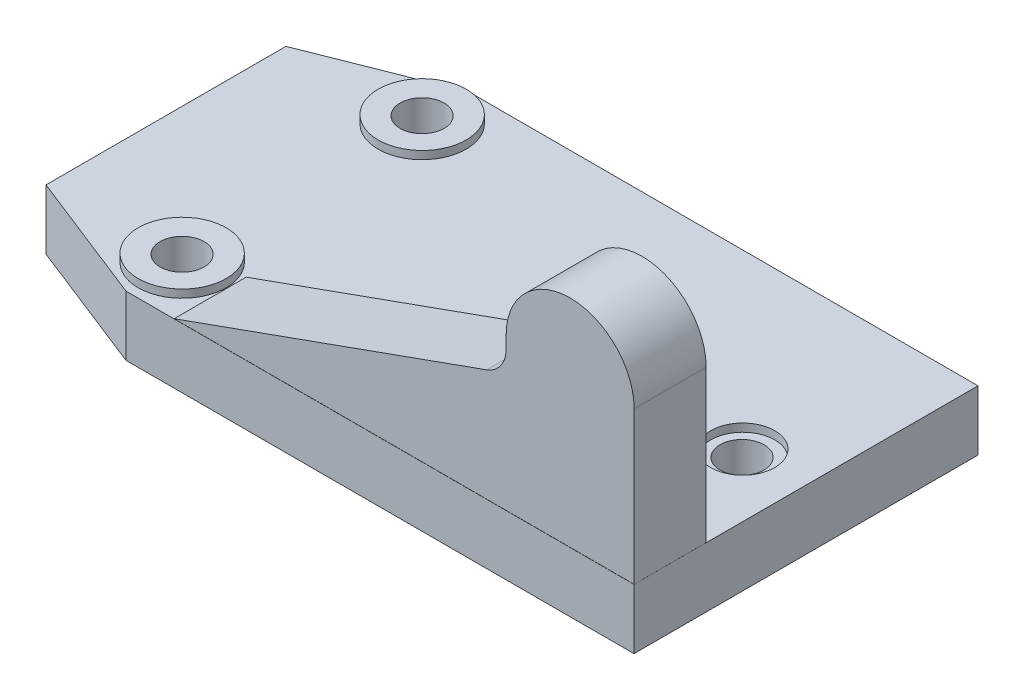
ISO-10303-21;
HEADER;
FILE_DESCRIPTION(('STEP AP214'),'2;1');
FILE_NAME('part.step','',(''),(''),'','','');
FILE_SCHEMA(('AUTOMOTIVE_DESIGN { 1 0 10303 214 1 1 1 1 }'));
ENDSEC;
DATA;
#1=APPLICATION_CONTEXT('core data for automotive mechanical design processes');
#2=APPLICATION_PROTOCOL_DEFINITION('international standard','automotive_design',2000,#1);
#3=PRODUCT_CONTEXT('',#1,'mechanical');
#4=PRODUCT('Part','Part','',(#3));
#5=PRODUCT_RELATED_PRODUCT_CATEGORY('part','',(#4));
#6=PRODUCT_DEFINITION_FORMATION('','',#4);
#7=PRODUCT_DEFINITION_CONTEXT('part definition',#1,'design');
#8=PRODUCT_DEFINITION('design','',#6,#7);
#9=PRODUCT_DEFINITION_SHAPE('','',#8);
#10=(LENGTH_UNIT() NAMED_UNIT(*) SI_UNIT(.MILLI.,.METRE.));
#11=(NAMED_UNIT(*) PLANE_ANGLE_UNIT() SI_UNIT($,.RADIAN.));
#12=(NAMED_UNIT(*) SI_UNIT($,.STERADIAN.) SOLID_ANGLE_UNIT());
#13=UNCERTAINTY_MEASURE_WITH_UNIT(LENGTH_MEASURE(1.E-05),#10,'distance_accuracy_value','');
#14=(GEOMETRIC_REPRESENTATION_CONTEXT(3) GLOBAL_UNCERTAINTY_ASSIGNED_CONTEXT((#13)) GLOBAL_UNIT_ASSIGNED_CONTEXT((#10,
#11,#12)) REPRESENTATION_CONTEXT('',''));
#15=CARTESIAN_POINT('',(0.,0.,0.));
#16=DIRECTION('',(0.,0.,1.));
#17=DIRECTION('',(1.,0.,0.));
#18=AXIS2_PLACEMENT_3D('',#15,#16,#17);
#19=CARTESIAN_POINT('',(-114.966174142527,15.0417249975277,-18.));
#20=DIRECTION('',(0.,1.,0.));
#21=DIRECTION('',(0.,0.,1.));
#22=AXIS2_PLACEMENT_3D('',#19,#20,#21);
#23=PLANE('',#22);
#24=DIRECTION('',(-1.,0.,0.));
#25=VECTOR('',#24,1.);
#26=CARTESIAN_POINT('',(-114.966174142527,15.0417249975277,0.));
#27=LINE('',#26,#25);
#28=CARTESIAN_POINT('',(0.0338258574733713,15.0417249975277,0.));
#29=VERTEX_POINT('',#28);
#30=CARTESIAN_POINT('',(-114.966174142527,15.0417249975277,0.));
#31=VERTEX_POINT('',#30);
#32=EDGE_CURVE('E95',#29,#31,#27,.T.);
#33=ORIENTED_EDGE('',*,*,#32,.T.);
#34=DIRECTION('',(0.,0.,1.));
#35=VECTOR('',#34,1.);
#36=CARTESIAN_POINT('',(-114.966174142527,15.0417249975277,-18.));
#37=LINE('',#36,#35);
#38=CARTESIAN_POINT('',(-114.966174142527,15.0417249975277,-18.));
#39=VERTEX_POINT('',#38);
#40=EDGE_CURVE('E12',#39,#31,#37,.T.);
#41=ORIENTED_EDGE('',*,*,#40,.F.);
#42=DIRECTION('',(-1.,0.,0.));
#43=VECTOR('',#42,1.);
#44=CARTESIAN_POINT('',(-114.966174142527,15.0417249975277,-18.));
#45=LINE('',#44,#43);
#46=CARTESIAN_POINT('',(0.0338258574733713,15.0417249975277,-18.));
#47=VERTEX_POINT('',#46);
#48=EDGE_CURVE('E118',#47,#39,#45,.T.);
#49=ORIENTED_EDGE('',*,*,#48,.F.);
#50=DIRECTION('',(0.,0.,1.));
#51=VECTOR('',#50,1.);
#52=CARTESIAN_POINT('',(0.0338258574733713,15.0417249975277,-18.));
#53=LINE('',#52,#51);
#54=EDGE_CURVE('E108',#47,#29,#53,.T.);
#55=ORIENTED_EDGE('',*,*,#54,.T.);
#56=EDGE_LOOP('',(#33,#41,#49,#55));
#57=FACE_BOUND('',#56,.T.);
#58=ADVANCED_FACE('F39',(#57),#23,.F.);
#59=CARTESIAN_POINT('',(-114.966174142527,15.0417249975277,-18.));
#60=DIRECTION('',(0.337349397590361,-0.941379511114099,0.));
#61=DIRECTION('',(0.941379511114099,0.337349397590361,0.));
#62=AXIS2_PLACEMENT_3D('',#59,#60,#61);
#63=PLANE('',#62);
#64=DIRECTION('',(0.941379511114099,0.337349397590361,0.));
#65=VECTOR('',#64,1.);
#66=CARTESIAN_POINT('',(-114.966174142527,15.0417249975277,0.));
#67=LINE('',#66,#65);
#68=CARTESIAN_POINT('',(-36.8316747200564,43.0417249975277,0.));
#69=VERTEX_POINT('',#68);
#70=EDGE_CURVE('E91',#31,#69,#67,.T.);
#71=ORIENTED_EDGE('',*,*,#70,.T.);
#72=DIRECTION('',(0.,0.,1.));
#73=VECTOR('',#72,1.);
#74=CARTESIAN_POINT('',(-36.8316747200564,43.0417249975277,-18.));
#75=LINE('',#74,#73);
#76=CARTESIAN_POINT('',(-36.8316747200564,43.0417249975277,-18.));
#77=VERTEX_POINT('',#76);
#78=EDGE_CURVE('E46',#77,#69,#75,.T.);
#79=ORIENTED_EDGE('',*,*,#78,.F.);
#80=DIRECTION('',(0.941379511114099,0.337349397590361,0.));
#81=VECTOR('',#80,1.);
#82=CARTESIAN_POINT('',(-114.966174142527,15.0417249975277,-18.));
#83=LINE('',#82,#81);
#84=EDGE_CURVE('E104',#39,#77,#83,.T.);
#85=ORIENTED_EDGE('',*,*,#84,.F.);
#86=ORIENTED_EDGE('',*,*,#40,.T.);
#87=EDGE_LOOP('',(#71,#79,#85,#86));
#88=FACE_BOUND('',#87,.T.);
#89=ADVANCED_FACE('F103',(#88),#63,.F.);
#90=CARTESIAN_POINT('',(-39.3086568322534,49.9537877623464,-18.));
#91=DIRECTION('',(0.,0.,1.));
#92=DIRECTION('',(1.,0.,0.));
#93=AXIS2_PLACEMENT_3D('',#90,#91,#92);
#94=CYLINDRICAL_SURFACE('',#93,7.34248268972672);
#95=CARTESIAN_POINT('',(-39.3086568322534,49.9537877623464,0.));
#96=DIRECTION('',(0.,0.,1.));
#97=DIRECTION('',(-1.,0.,0.));
#98=AXIS2_PLACEMENT_3D('',#95,#96,#97);
#99=CIRCLE('',#98,7.34248268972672);
#100=CARTESIAN_POINT('',(-31.9661741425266,49.9537877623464,0.));
#101=VERTEX_POINT('',#100);
#102=EDGE_CURVE('E97',#69,#101,#99,.T.);
#103=ORIENTED_EDGE('',*,*,#102,.T.);
#104=DIRECTION('',(0.,0.,1.));
#105=VECTOR('',#104,1.);
#106=CARTESIAN_POINT('',(-31.9661741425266,49.9537877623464,-18.));
#107=LINE('',#106,#105);
#108=CARTESIAN_POINT('',(-31.9661741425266,49.9537877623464,-18.));
#109=VERTEX_POINT('',#108);
#110=EDGE_CURVE('E134',#109,#101,#107,.T.);
#111=ORIENTED_EDGE('',*,*,#110,.F.);
#112=CARTESIAN_POINT('',(-39.3086568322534,49.9537877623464,-18.));
#113=DIRECTION('',(0.,0.,1.));
#114=DIRECTION('',(-1.,0.,0.));
#115=AXIS2_PLACEMENT_3D('',#112,#113,#114);
#116=CIRCLE('',#115,7.34248268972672);
#117=EDGE_CURVE('E121',#77,#109,#116,.T.);
#118=ORIENTED_EDGE('',*,*,#117,.F.);
#119=ORIENTED_EDGE('',*,*,#78,.T.);
#120=EDGE_LOOP('',(#103,#111,#118,#119));
#121=FACE_BOUND('',#120,.T.);
#122=ADVANCED_FACE('F138',(#121),#94,.F.);
#123=CARTESIAN_POINT('',(-31.9661741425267,53.0417249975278,-18.));
#124=DIRECTION('',(1.,0.,0.));
#125=DIRECTION('',(0.,1.,0.));
#126=AXIS2_PLACEMENT_3D('',#123,#124,#125);
#127=PLANE('',#126);
#128=DIRECTION('',(0.,1.,0.));
#129=VECTOR('',#128,1.);
#130=CARTESIAN_POINT('',(-31.9661741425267,53.0417249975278,0.));
#131=LINE('',#130,#129);
#132=CARTESIAN_POINT('',(-31.9661741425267,53.0417249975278,0.));
#133=VERTEX_POINT('',#132);
#134=EDGE_CURVE('E112',#101,#133,#131,.T.);
#135=ORIENTED_EDGE('',*,*,#134,.T.);
#136=DIRECTION('',(0.,0.,1.));
#137=VECTOR('',#136,1.);
#138=CARTESIAN_POINT('',(-31.9661741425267,53.0417249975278,-18.));
#139=LINE('',#138,#137);
#140=CARTESIAN_POINT('',(-31.9661741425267,53.0417249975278,-18.));
#141=VERTEX_POINT('',#140);
#142=EDGE_CURVE('E131',#141,#133,#139,.T.);
#143=ORIENTED_EDGE('',*,*,#142,.F.);
#144=DIRECTION('',(0.,1.,0.));
#145=VECTOR('',#144,1.);
#146=CARTESIAN_POINT('',(-31.9661741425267,53.0417249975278,-18.));
#147=LINE('',#146,#145);
#148=EDGE_CURVE('E123',#109,#141,#147,.T.);
#149=ORIENTED_EDGE('',*,*,#148,.F.);
#150=ORIENTED_EDGE('',*,*,#110,.T.);
#151=EDGE_LOOP('',(#135,#143,#149,#150));
#152=FACE_BOUND('',#151,.T.);
#153=ADVANCED_FACE('F144',(#152),#127,.F.);
#154=CARTESIAN_POINT('',(-15.9661741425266,53.0417249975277,-18.));
#155=DIRECTION('',(0.,0.,1.));
#156=DIRECTION('',(1.,0.,0.));
#157=AXIS2_PLACEMENT_3D('',#154,#155,#156);
#158=CYLINDRICAL_SURFACE('',#157,16.);
#159=CARTESIAN_POINT('',(-15.9661741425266,53.0417249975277,0.));
#160=DIRECTION('',(0.,0.,-1.));
#161=DIRECTION('',(1.,0.,0.));
#162=AXIS2_PLACEMENT_3D('',#159,#160,#161);
#163=CIRCLE('',#162,16.);
#164=CARTESIAN_POINT('',(0.0338258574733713,53.0417249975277,0.));
#165=VERTEX_POINT('',#164);
#166=EDGE_CURVE('E114',#133,#165,#163,.T.);
#167=ORIENTED_EDGE('',*,*,#166,.T.);
#168=DIRECTION('',(0.,0.,1.));
#169=VECTOR('',#168,1.);
#170=CARTESIAN_POINT('',(0.0338258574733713,53.0417249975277,-18.));
#171=LINE('',#170,#169);
#172=CARTESIAN_POINT('',(0.0338258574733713,53.0417249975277,-18.));
#173=VERTEX_POINT('',#172);
#174=EDGE_CURVE('E128',#173,#165,#171,.T.);
#175=ORIENTED_EDGE('',*,*,#174,.F.);
#176=CARTESIAN_POINT('',(-15.9661741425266,53.0417249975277,-18.));
#177=DIRECTION('',(0.,0.,-1.));
#178=DIRECTION('',(1.,0.,0.));
#179=AXIS2_PLACEMENT_3D('',#176,#177,#178);
#180=CIRCLE('',#179,16.);
#181=EDGE_CURVE('E58',#141,#173,#180,.T.);
#182=ORIENTED_EDGE('',*,*,#181,.F.);
#183=ORIENTED_EDGE('',*,*,#142,.T.);
#184=EDGE_LOOP('',(#167,#175,#182,#183));
#185=FACE_BOUND('',#184,.T.);
#186=ADVANCED_FACE('F147',(#185),#158,.T.);
#187=CARTESIAN_POINT('',(0.0338258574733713,15.0417249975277,-18.));
#188=DIRECTION('',(-1.,0.,0.));
#189=DIRECTION('',(0.,0.,1.));
#190=AXIS2_PLACEMENT_3D('',#187,#188,#189);
#191=PLANE('',#190);
#192=DIRECTION('',(0.,-1.,0.));
#193=VECTOR('',#192,1.);
#194=CARTESIAN_POINT('',(0.0338258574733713,15.0417249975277,0.));
#195=LINE('',#194,#193);
#196=EDGE_CURVE('E116',#165,#29,#195,.T.);
#197=ORIENTED_EDGE('',*,*,#196,.T.);
#198=ORIENTED_EDGE('',*,*,#54,.F.);
#199=DIRECTION('',(0.,-1.,0.));
#200=VECTOR('',#199,1.);
#201=CARTESIAN_POINT('',(0.0338258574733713,15.0417249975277,-18.));
#202=LINE('',#201,#200);
#203=EDGE_CURVE('E53',#173,#47,#202,.T.);
#204=ORIENTED_EDGE('',*,*,#203,.F.);
#205=ORIENTED_EDGE('',*,*,#174,.T.);
#206=EDGE_LOOP('',(#197,#198,#204,#205));
#207=FACE_BOUND('',#206,.T.);
#208=ADVANCED_FACE('F149',(#207),#191,.F.);
#209=CARTESIAN_POINT('',(-15.9661741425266,53.0417249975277,-18.));
#210=DIRECTION('',(0.,0.,1.));
#211=DIRECTION('',(1.,0.,0.));
#212=AXIS2_PLACEMENT_3D('',#209,#210,#211);
#213=PLANE('',#212);
#214=ORIENTED_EDGE('',*,*,#48,.T.);
#215=ORIENTED_EDGE('',*,*,#84,.T.);
#216=ORIENTED_EDGE('',*,*,#117,.T.);
#217=ORIENTED_EDGE('',*,*,#148,.T.);
#218=ORIENTED_EDGE('',*,*,#181,.T.);
#219=ORIENTED_EDGE('',*,*,#203,.T.);
#220=EDGE_LOOP('',(#214,#215,#216,#217,#218,#219));
#221=FACE_BOUND('',#220,.T.);
#222=ADVANCED_FACE('F141',(#221),#213,.F.);
#223=CARTESIAN_POINT('',(-15.9661741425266,53.0417249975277,0.));
#224=DIRECTION('',(0.,0.,1.));
#225=DIRECTION('',(1.,0.,0.));
#226=AXIS2_PLACEMENT_3D('',#223,#224,#225);
#227=PLANE('',#226);
#228=ORIENTED_EDGE('',*,*,#32,.F.);
#229=ORIENTED_EDGE('',*,*,#196,.F.);
#230=ORIENTED_EDGE('',*,*,#166,.F.);
#231=ORIENTED_EDGE('',*,*,#134,.F.);
#232=ORIENTED_EDGE('',*,*,#102,.F.);
#233=ORIENTED_EDGE('',*,*,#70,.F.);
#234=EDGE_LOOP('',(#228,#229,#230,#231,#232,#233));
#235=FACE_BOUND('',#234,.T.);
#236=ADVANCED_FACE('F92',(#235),#227,.T.);
#237=CLOSED_SHELL('',(#58,#89,#122,#153,#186,#208,#222,#236));
#238=MANIFOLD_SOLID_BREP('B2',#237);
#239=CARTESIAN_POINT('',(-16.,0.,-43.));
#240=DIRECTION('',(0.,1.,0.));
#241=DIRECTION('',(0.,0.,1.));
#242=AXIS2_PLACEMENT_3D('',#239,#240,#241);
#243=CYLINDRICAL_SURFACE('',#242,5.5);
#244=CARTESIAN_POINT('',(-16.,0.,-43.));
#245=DIRECTION('',(0.,1.,0.));
#246=DIRECTION('',(0.,0.,1.));
#247=AXIS2_PLACEMENT_3D('',#244,#245,#246);
#248=CIRCLE('',#247,5.5);
#249=CARTESIAN_POINT('',(-16.,0.,-37.5));
#250=VERTEX_POINT('',#249);
#251=EDGE_CURVE('E392',#250,#250,#248,.T.);
#252=ORIENTED_EDGE('',*,*,#251,.F.);
#253=EDGE_LOOP('',(#252));
#254=FACE_BOUND('',#253,.T.);
#255=CARTESIAN_POINT('',(-16.,12.9999999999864,-43.));
#256=DIRECTION('',(0.,1.,0.));
#257=DIRECTION('',(0.,0.,1.));
#258=AXIS2_PLACEMENT_3D('',#255,#256,#257);
#259=CIRCLE('',#258,5.5);
#260=CARTESIAN_POINT('',(-16.,12.9999999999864,-37.5));
#261=VERTEX_POINT('',#260);
#262=EDGE_CURVE('E203',#261,#261,#259,.F.);
#263=ORIENTED_EDGE('',*,*,#262,.F.);
#264=EDGE_LOOP('',(#263));
#265=FACE_BOUND('',#264,.T.);
#266=ADVANCED_FACE('F199',(#254,#265),#243,.F.);
#267=CARTESIAN_POINT('',(0.,15.,0.));
#268=DIRECTION('',(0.,1.,0.));
#269=DIRECTION('',(0.,0.,1.));
#270=AXIS2_PLACEMENT_3D('',#267,#268,#269);
#271=PLANE('',#270);
#272=CARTESIAN_POINT('',(-15.6990837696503,14.9999999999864,-42.8825657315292));
#273=DIRECTION('',(0.,1.,0.));
#274=DIRECTION('',(0.,0.,1.));
#275=AXIS2_PLACEMENT_3D('',#272,#273,#274);
#276=CIRCLE('',#275,8.);
#277=CARTESIAN_POINT('',(-15.6990837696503,14.9999999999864,-34.8825657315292));
#278=VERTEX_POINT('',#277);
#279=EDGE_CURVE('E398',#278,#278,#276,.T.);
#280=ORIENTED_EDGE('',*,*,#279,.F.);
#281=EDGE_LOOP('',(#280));
#282=FACE_BOUND('',#281,.T.);
#283=CARTESIAN_POINT('',(-126.198641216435,14.9999999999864,-13.2444372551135));
#284=DIRECTION('',(0.,1.,0.));
#285=DIRECTION('',(0.,0.,1.));
#286=AXIS2_PLACEMENT_3D('',#283,#284,#285);
#287=CIRCLE('',#286,11.);
#288=CARTESIAN_POINT('',(-126.198641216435,14.9999999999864,-2.24443725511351));
#289=VERTEX_POINT('',#288);
#290=EDGE_CURVE('E274',#289,#289,#287,.T.);
#291=ORIENTED_EDGE('',*,*,#290,.F.);
#292=EDGE_LOOP('',(#291));
#293=FACE_BOUND('',#292,.T.);
#294=DIRECTION('',(1.,0.,0.));
#295=VECTOR('',#294,1.);
#296=CARTESIAN_POINT('',(-127.,15.,0.));
#297=LINE('',#296,#295);
#298=CARTESIAN_POINT('',(-127.,15.,0.));
#299=VERTEX_POINT('',#298);
#300=CARTESIAN_POINT('',(0.,15.,0.));
#301=VERTEX_POINT('',#300);
#302=EDGE_CURVE('E285',#299,#301,#297,.T.);
#303=ORIENTED_EDGE('',*,*,#302,.T.);
#304=DIRECTION('',(0.,0.,-1.));
#305=VECTOR('',#304,1.);
#306=CARTESIAN_POINT('',(0.,15.,0.));
#307=LINE('',#306,#305);
#308=CARTESIAN_POINT('',(0.,15.,-86.));
#309=VERTEX_POINT('',#308);
#310=EDGE_CURVE('E266',#301,#309,#307,.T.);
#311=ORIENTED_EDGE('',*,*,#310,.T.);
#312=DIRECTION('',(-1.,0.,0.));
#313=VECTOR('',#312,1.);
#314=CARTESIAN_POINT('',(0.,15.,-86.));
#315=LINE('',#314,#313);
#316=CARTESIAN_POINT('',(-127.,15.,-86.));
#317=VERTEX_POINT('',#316);
#318=EDGE_CURVE('E288',#309,#317,#315,.T.);
#319=ORIENTED_EDGE('',*,*,#318,.T.);
#320=DIRECTION('',(-0.930408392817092,0.,0.366524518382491));
#321=VECTOR('',#320,1.);
#322=CARTESIAN_POINT('',(-127.,15.,-86.));
#323=LINE('',#322,#321);
#324=CARTESIAN_POINT('',(-160.,15.,-73.));
#325=VERTEX_POINT('',#324);
#326=EDGE_CURVE('E290',#317,#325,#323,.T.);
#327=ORIENTED_EDGE('',*,*,#326,.T.);
#328=DIRECTION('',(0.,0.,1.));
#329=VECTOR('',#328,1.);
#330=CARTESIAN_POINT('',(-160.,15.,-73.));
#331=LINE('',#330,#329);
#332=CARTESIAN_POINT('',(-160.,15.,-13.));
#333=VERTEX_POINT('',#332);
#334=EDGE_CURVE('E220',#325,#333,#331,.T.);
#335=ORIENTED_EDGE('',*,*,#334,.T.);
#336=DIRECTION('',(0.930408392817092,0.,0.366524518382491));
#337=VECTOR('',#336,1.);
#338=CARTESIAN_POINT('',(-160.,15.,-13.));
#339=LINE('',#338,#337);
#340=EDGE_CURVE('E215',#333,#299,#339,.T.);
#341=ORIENTED_EDGE('',*,*,#340,.T.);
#342=EDGE_LOOP('',(#303,#311,#319,#327,#335,#341));
#343=FACE_BOUND('',#342,.T.);
#344=CARTESIAN_POINT('',(-126.198641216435,14.9999999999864,-73.2444372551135));
#345=DIRECTION('',(0.,1.,0.));
#346=DIRECTION('',(0.,0.,1.));
#347=AXIS2_PLACEMENT_3D('',#344,#345,#346);
#348=CIRCLE('',#347,11.);
#349=CARTESIAN_POINT('',(-126.198641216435,14.9999999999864,-62.2444372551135));
#350=VERTEX_POINT('',#349);
#351=EDGE_CURVE('E375',#350,#350,#348,.T.);
#352=ORIENTED_EDGE('',*,*,#351,.F.);
#353=EDGE_LOOP('',(#352));
#354=FACE_BOUND('',#353,.T.);
#355=ADVANCED_FACE('F309',(#282,#293,#343,#354),#271,.T.);
#356=CARTESIAN_POINT('',(-127.,15.,0.));
#357=DIRECTION('',(0.,0.,-1.));
#358=DIRECTION('',(-1.,0.,0.));
#359=AXIS2_PLACEMENT_3D('',#356,#357,#358);
#360=PLANE('',#359);
#361=DIRECTION('',(1.,0.,0.));
#362=VECTOR('',#361,1.);
#363=CARTESIAN_POINT('',(-127.,0.,0.));
#364=LINE('',#363,#362);
#365=CARTESIAN_POINT('',(-127.,0.,0.));
#366=VERTEX_POINT('',#365);
#367=CARTESIAN_POINT('',(0.,0.,0.));
#368=VERTEX_POINT('',#367);
#369=EDGE_CURVE('E257',#366,#368,#364,.T.);
#370=ORIENTED_EDGE('',*,*,#369,.T.);
#371=DIRECTION('',(0.,-1.,0.));
#372=VECTOR('',#371,1.);
#373=CARTESIAN_POINT('',(0.,15.,0.));
#374=LINE('',#373,#372);
#375=EDGE_CURVE('E37',#301,#368,#374,.T.);
#376=ORIENTED_EDGE('',*,*,#375,.F.);
#377=ORIENTED_EDGE('',*,*,#302,.F.);
#378=DIRECTION('',(0.,-1.,0.));
#379=VECTOR('',#378,1.);
#380=CARTESIAN_POINT('',(-127.,15.,0.));
#381=LINE('',#380,#379);
#382=EDGE_CURVE('E270',#299,#366,#381,.T.);
#383=ORIENTED_EDGE('',*,*,#382,.T.);
#384=EDGE_LOOP('',(#370,#376,#377,#383));
#385=FACE_BOUND('',#384,.T.);
#386=ADVANCED_FACE('F201',(#385),#360,.F.);
#387=CARTESIAN_POINT('',(0.,15.,0.));
#388=DIRECTION('',(-1.,0.,0.));
#389=DIRECTION('',(0.,0.,1.));
#390=AXIS2_PLACEMENT_3D('',#387,#388,#389);
#391=PLANE('',#390);
#392=DIRECTION('',(0.,0.,-1.));
#393=VECTOR('',#392,1.);
#394=CARTESIAN_POINT('',(0.,0.,0.));
#395=LINE('',#394,#393);
#396=CARTESIAN_POINT('',(0.,0.,-86.));
#397=VERTEX_POINT('',#396);
#398=EDGE_CURVE('E253',#368,#397,#395,.T.);
#399=ORIENTED_EDGE('',*,*,#398,.T.);
#400=DIRECTION('',(0.,-1.,0.));
#401=VECTOR('',#400,1.);
#402=CARTESIAN_POINT('',(0.,15.,-86.));
#403=LINE('',#402,#401);
#404=EDGE_CURVE('E208',#309,#397,#403,.T.);
#405=ORIENTED_EDGE('',*,*,#404,.F.);
#406=ORIENTED_EDGE('',*,*,#310,.F.);
#407=ORIENTED_EDGE('',*,*,#375,.T.);
#408=EDGE_LOOP('',(#399,#405,#406,#407));
#409=FACE_BOUND('',#408,.T.);
#410=ADVANCED_FACE('F265',(#409),#391,.F.);
#411=CARTESIAN_POINT('',(0.,15.,-86.));
#412=DIRECTION('',(0.,0.,1.));
#413=DIRECTION('',(1.,0.,0.));
#414=AXIS2_PLACEMENT_3D('',#411,#412,#413);
#415=PLANE('',#414);
#416=DIRECTION('',(-1.,0.,0.));
#417=VECTOR('',#416,1.);
#418=CARTESIAN_POINT('',(0.,0.,-86.));
#419=LINE('',#418,#417);
#420=CARTESIAN_POINT('',(-127.,0.,-86.));
#421=VERTEX_POINT('',#420);
#422=EDGE_CURVE('E259',#397,#421,#419,.T.);
#423=ORIENTED_EDGE('',*,*,#422,.T.);
#424=DIRECTION('',(0.,-1.,0.));
#425=VECTOR('',#424,1.);
#426=CARTESIAN_POINT('',(-127.,15.,-86.));
#427=LINE('',#426,#425);
#428=EDGE_CURVE('E301',#317,#421,#427,.T.);
#429=ORIENTED_EDGE('',*,*,#428,.F.);
#430=ORIENTED_EDGE('',*,*,#318,.F.);
#431=ORIENTED_EDGE('',*,*,#404,.T.);
#432=EDGE_LOOP('',(#423,#429,#430,#431));
#433=FACE_BOUND('',#432,.T.);
#434=ADVANCED_FACE('F306',(#433),#415,.F.);
#435=CARTESIAN_POINT('',(-127.,15.,-86.));
#436=DIRECTION('',(0.366524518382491,0.,0.930408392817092));
#437=DIRECTION('',(0.930408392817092,0.,-0.366524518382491));
#438=AXIS2_PLACEMENT_3D('',#435,#436,#437);
#439=PLANE('',#438);
#440=DIRECTION('',(-0.930408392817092,0.,0.366524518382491));
#441=VECTOR('',#440,1.);
#442=CARTESIAN_POINT('',(-127.,0.,-86.));
#443=LINE('',#442,#441);
#444=CARTESIAN_POINT('',(-160.,0.,-73.));
#445=VERTEX_POINT('',#444);
#446=EDGE_CURVE('E279',#421,#445,#443,.T.);
#447=ORIENTED_EDGE('',*,*,#446,.T.);
#448=DIRECTION('',(0.,-1.,0.));
#449=VECTOR('',#448,1.);
#450=CARTESIAN_POINT('',(-160.,15.,-73.));
#451=LINE('',#450,#449);
#452=EDGE_CURVE('E298',#325,#445,#451,.T.);
#453=ORIENTED_EDGE('',*,*,#452,.F.);
#454=ORIENTED_EDGE('',*,*,#326,.F.);
#455=ORIENTED_EDGE('',*,*,#428,.T.);
#456=EDGE_LOOP('',(#447,#453,#454,#455));
#457=FACE_BOUND('',#456,.T.);
#458=ADVANCED_FACE('F313',(#457),#439,.F.);
#459=CARTESIAN_POINT('',(-160.,15.,-73.));
#460=DIRECTION('',(1.,0.,0.));
#461=DIRECTION('',(0.,0.,-1.));
#462=AXIS2_PLACEMENT_3D('',#459,#460,#461);
#463=PLANE('',#462);
#464=DIRECTION('',(0.,0.,1.));
#465=VECTOR('',#464,1.);
#466=CARTESIAN_POINT('',(-160.,0.,-73.));
#467=LINE('',#466,#465);
#468=CARTESIAN_POINT('',(-160.,0.,-13.));
#469=VERTEX_POINT('',#468);
#470=EDGE_CURVE('E281',#445,#469,#467,.T.);
#471=ORIENTED_EDGE('',*,*,#470,.T.);
#472=DIRECTION('',(0.,-1.,0.));
#473=VECTOR('',#472,1.);
#474=CARTESIAN_POINT('',(-160.,15.,-13.));
#475=LINE('',#474,#473);
#476=EDGE_CURVE('E295',#333,#469,#475,.T.);
#477=ORIENTED_EDGE('',*,*,#476,.F.);
#478=ORIENTED_EDGE('',*,*,#334,.F.);
#479=ORIENTED_EDGE('',*,*,#452,.T.);
#480=EDGE_LOOP('',(#471,#477,#478,#479));
#481=FACE_BOUND('',#480,.T.);
#482=ADVANCED_FACE('F316',(#481),#463,.F.);
#483=CARTESIAN_POINT('',(-160.,15.,-13.));
#484=DIRECTION('',(0.366524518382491,0.,-0.930408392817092));
#485=DIRECTION('',(-0.930408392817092,0.,-0.366524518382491));
#486=AXIS2_PLACEMENT_3D('',#483,#484,#485);
#487=PLANE('',#486);
#488=DIRECTION('',(0.930408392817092,0.,0.366524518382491));
#489=VECTOR('',#488,1.);
#490=CARTESIAN_POINT('',(-160.,0.,-13.));
#491=LINE('',#490,#489);
#492=EDGE_CURVE('E283',#469,#366,#491,.T.);
#493=ORIENTED_EDGE('',*,*,#492,.T.);
#494=ORIENTED_EDGE('',*,*,#382,.F.);
#495=ORIENTED_EDGE('',*,*,#340,.F.);
#496=ORIENTED_EDGE('',*,*,#476,.T.);
#497=EDGE_LOOP('',(#493,#494,#495,#496));
#498=FACE_BOUND('',#497,.T.);
#499=ADVANCED_FACE('F318',(#498),#487,.F.);
#500=CARTESIAN_POINT('',(0.,0.,0.));
#501=DIRECTION('',(0.,1.,0.));
#502=DIRECTION('',(0.,0.,1.));
#503=AXIS2_PLACEMENT_3D('',#500,#501,#502);
#504=PLANE('',#503);
#505=ORIENTED_EDGE('',*,*,#251,.T.);
#506=EDGE_LOOP('',(#505));
#507=FACE_BOUND('',#506,.T.);
#508=CARTESIAN_POINT('',(-125.962194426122,0.,-12.9860809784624));
#509=DIRECTION('',(0.,1.,0.));
#510=DIRECTION('',(0.,0.,1.));
#511=AXIS2_PLACEMENT_3D('',#508,#509,#510);
#512=CIRCLE('',#511,5.49999999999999);
#513=CARTESIAN_POINT('',(-125.962194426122,0.,-7.48608097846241));
#514=VERTEX_POINT('',#513);
#515=EDGE_CURVE('E386',#514,#514,#512,.T.);
#516=ORIENTED_EDGE('',*,*,#515,.T.);
#517=EDGE_LOOP('',(#516));
#518=FACE_BOUND('',#517,.T.);
#519=CARTESIAN_POINT('',(-125.962194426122,0.,-72.9860809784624));
#520=DIRECTION('',(0.,1.,0.));
#521=DIRECTION('',(0.,0.,1.));
#522=AXIS2_PLACEMENT_3D('',#519,#520,#521);
#523=CIRCLE('',#522,5.49999999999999);
#524=CARTESIAN_POINT('',(-125.962194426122,0.,-67.4860809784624));
#525=VERTEX_POINT('',#524);
#526=EDGE_CURVE('E380',#525,#525,#523,.T.);
#527=ORIENTED_EDGE('',*,*,#526,.T.);
#528=EDGE_LOOP('',(#527));
#529=FACE_BOUND('',#528,.T.);
#530=ORIENTED_EDGE('',*,*,#369,.F.);
#531=ORIENTED_EDGE('',*,*,#492,.F.);
#532=ORIENTED_EDGE('',*,*,#470,.F.);
#533=ORIENTED_EDGE('',*,*,#446,.F.);
#534=ORIENTED_EDGE('',*,*,#422,.F.);
#535=ORIENTED_EDGE('',*,*,#398,.F.);
#536=EDGE_LOOP('',(#530,#531,#532,#533,#534,#535));
#537=FACE_BOUND('',#536,.T.);
#538=ADVANCED_FACE('F254',(#507,#518,#529,#537),#504,.F.);
#539=CARTESIAN_POINT('',(-126.198641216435,16.9999999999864,-13.2444372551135));
#540=DIRECTION('',(0.,-1.,0.));
#541=DIRECTION('',(0.,0.,-1.));
#542=AXIS2_PLACEMENT_3D('',#539,#540,#541);
#543=CYLINDRICAL_SURFACE('',#542,11.);
#544=CARTESIAN_POINT('',(-126.198641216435,16.9999999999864,-13.2444372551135));
#545=DIRECTION('',(0.,1.,0.));
#546=DIRECTION('',(0.,0.,1.));
#547=AXIS2_PLACEMENT_3D('',#544,#545,#546);
#548=CIRCLE('',#547,11.);
#549=CARTESIAN_POINT('',(-126.198641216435,16.9999999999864,-2.24443725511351));
#550=VERTEX_POINT('',#549);
#551=EDGE_CURVE('E271',#550,#550,#548,.T.);
#552=ORIENTED_EDGE('',*,*,#551,.F.);
#553=EDGE_LOOP('',(#552));
#554=FACE_BOUND('',#553,.T.);
#555=ORIENTED_EDGE('',*,*,#290,.T.);
#556=EDGE_LOOP('',(#555));
#557=FACE_BOUND('',#556,.T.);
#558=ADVANCED_FACE('F326',(#554,#557),#543,.T.);
#559=CARTESIAN_POINT('',(-126.198641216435,16.9999999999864,-13.2444372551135));
#560=DIRECTION('',(0.,1.,0.));
#561=DIRECTION('',(0.,0.,1.));
#562=AXIS2_PLACEMENT_3D('',#559,#560,#561);
#563=PLANE('',#562);
#564=CARTESIAN_POINT('',(-125.962194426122,16.9999999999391,-12.9860809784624));
#565=DIRECTION('',(0.,1.,0.));
#566=DIRECTION('',(0.,0.,1.));
#567=AXIS2_PLACEMENT_3D('',#564,#565,#566);
#568=CIRCLE('',#567,5.49999999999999);
#569=CARTESIAN_POINT('',(-125.962194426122,16.9999999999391,-7.48608097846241));
#570=VERTEX_POINT('',#569);
#571=EDGE_CURVE('E389',#570,#570,#568,.T.);
#572=ORIENTED_EDGE('',*,*,#571,.F.);
#573=EDGE_LOOP('',(#572));
#574=FACE_BOUND('',#573,.T.);
#575=ORIENTED_EDGE('',*,*,#551,.T.);
#576=EDGE_LOOP('',(#575));
#577=FACE_BOUND('',#576,.T.);
#578=ADVANCED_FACE('F360',(#574,#577),#563,.T.);
#579=CARTESIAN_POINT('',(-126.198641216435,16.9999999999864,-73.2444372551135));
#580=DIRECTION('',(0.,-1.,0.));
#581=DIRECTION('',(0.,0.,-1.));
#582=AXIS2_PLACEMENT_3D('',#579,#580,#581);
#583=CYLINDRICAL_SURFACE('',#582,11.);
#584=CARTESIAN_POINT('',(-126.198641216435,16.9999999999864,-73.2444372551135));
#585=DIRECTION('',(0.,1.,0.));
#586=DIRECTION('',(0.,0.,1.));
#587=AXIS2_PLACEMENT_3D('',#584,#585,#586);
#588=CIRCLE('',#587,11.);
#589=CARTESIAN_POINT('',(-126.198641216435,16.9999999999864,-62.2444372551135));
#590=VERTEX_POINT('',#589);
#591=EDGE_CURVE('E373',#590,#590,#588,.T.);
#592=ORIENTED_EDGE('',*,*,#591,.F.);
#593=EDGE_LOOP('',(#592));
#594=FACE_BOUND('',#593,.T.);
#595=ORIENTED_EDGE('',*,*,#351,.T.);
#596=EDGE_LOOP('',(#595));
#597=FACE_BOUND('',#596,.T.);
#598=ADVANCED_FACE('F356',(#594,#597),#583,.T.);
#599=CARTESIAN_POINT('',(-126.198641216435,16.9999999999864,-73.2444372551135));
#600=DIRECTION('',(0.,1.,0.));
#601=DIRECTION('',(0.,0.,1.));
#602=AXIS2_PLACEMENT_3D('',#599,#600,#601);
#603=PLANE('',#602);
#604=CARTESIAN_POINT('',(-125.962194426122,16.9999999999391,-72.9860809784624));
#605=DIRECTION('',(0.,1.,0.));
#606=DIRECTION('',(0.,0.,1.));
#607=AXIS2_PLACEMENT_3D('',#604,#605,#606);
#608=CIRCLE('',#607,5.49999999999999);
#609=CARTESIAN_POINT('',(-125.962194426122,16.9999999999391,-67.4860809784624));
#610=VERTEX_POINT('',#609);
#611=EDGE_CURVE('E383',#610,#610,#608,.T.);
#612=ORIENTED_EDGE('',*,*,#611,.F.);
#613=EDGE_LOOP('',(#612));
#614=FACE_BOUND('',#613,.T.);
#615=ORIENTED_EDGE('',*,*,#591,.T.);
#616=EDGE_LOOP('',(#615));
#617=FACE_BOUND('',#616,.T.);
#618=ADVANCED_FACE('F352',(#614,#617),#603,.T.);
#619=CARTESIAN_POINT('',(-125.962194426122,0.,-72.9860809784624));
#620=DIRECTION('',(0.,1.,0.));
#621=DIRECTION('',(0.,0.,1.));
#622=AXIS2_PLACEMENT_3D('',#619,#620,#621);
#623=CYLINDRICAL_SURFACE('',#622,5.49999999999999);
#624=ORIENTED_EDGE('',*,*,#526,.F.);
#625=EDGE_LOOP('',(#624));
#626=FACE_BOUND('',#625,.T.);
#627=ORIENTED_EDGE('',*,*,#611,.T.);
#628=EDGE_LOOP('',(#627));
#629=FACE_BOUND('',#628,.T.);
#630=ADVANCED_FACE('F348',(#626,#629),#623,.F.);
#631=CARTESIAN_POINT('',(-125.962194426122,0.,-12.9860809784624));
#632=DIRECTION('',(0.,1.,0.));
#633=DIRECTION('',(0.,0.,1.));
#634=AXIS2_PLACEMENT_3D('',#631,#632,#633);
#635=CYLINDRICAL_SURFACE('',#634,5.49999999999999);
#636=ORIENTED_EDGE('',*,*,#515,.F.);
#637=EDGE_LOOP('',(#636));
#638=FACE_BOUND('',#637,.T.);
#639=ORIENTED_EDGE('',*,*,#571,.T.);
#640=EDGE_LOOP('',(#639));
#641=FACE_BOUND('',#640,.T.);
#642=ADVANCED_FACE('F345',(#638,#641),#635,.F.);
#643=CARTESIAN_POINT('',(-15.6990837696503,12.9999999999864,-42.8825657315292));
#644=DIRECTION('',(0.,1.,0.));
#645=DIRECTION('',(0.,0.,1.));
#646=AXIS2_PLACEMENT_3D('',#643,#644,#645);
#647=PLANE('',#646);
#648=CARTESIAN_POINT('',(-15.6990837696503,12.9999999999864,-42.8825657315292));
#649=DIRECTION('',(0.,1.,0.));
#650=DIRECTION('',(0.,0.,1.));
#651=AXIS2_PLACEMENT_3D('',#648,#649,#650);
#652=CIRCLE('',#651,8.);
#653=CARTESIAN_POINT('',(-15.6990837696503,12.9999999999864,-34.8825657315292));
#654=VERTEX_POINT('',#653);
#655=EDGE_CURVE('E395',#654,#654,#652,.T.);
#656=ORIENTED_EDGE('',*,*,#655,.T.);
#657=EDGE_LOOP('',(#656));
#658=FACE_BOUND('',#657,.T.);
#659=ORIENTED_EDGE('',*,*,#262,.T.);
#660=EDGE_LOOP('',(#659));
#661=FACE_BOUND('',#660,.T.);
#662=ADVANCED_FACE('F347',(#658,#661),#647,.T.);
#663=CARTESIAN_POINT('',(-15.6990837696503,12.9999999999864,-42.8825657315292));
#664=DIRECTION('',(0.,1.,0.));
#665=DIRECTION('',(0.,0.,1.));
#666=AXIS2_PLACEMENT_3D('',#663,#664,#665);
#667=CYLINDRICAL_SURFACE('',#666,8.);
#668=ORIENTED_EDGE('',*,*,#655,.F.);
#669=EDGE_LOOP('',(#668));
#670=FACE_BOUND('',#669,.T.);
#671=ORIENTED_EDGE('',*,*,#279,.T.);
#672=EDGE_LOOP('',(#671));
#673=FACE_BOUND('',#672,.T.);
#674=ADVANCED_FACE('F343',(#670,#673),#667,.F.);
#675=CLOSED_SHELL('',(#266,#355,#386,#410,#434,#458,#482,#499,#538,#558,#578,#598,#618,#630,
#642,#662,#674));
#676=MANIFOLD_SOLID_BREP('B6',#675);
#677=ADVANCED_BREP_SHAPE_REPRESENTATION('',(#18,#238,#676),#14);
#678=SHAPE_DEFINITION_REPRESENTATION(#9,#677);
ENDSEC;
END-ISO-10303-21;
